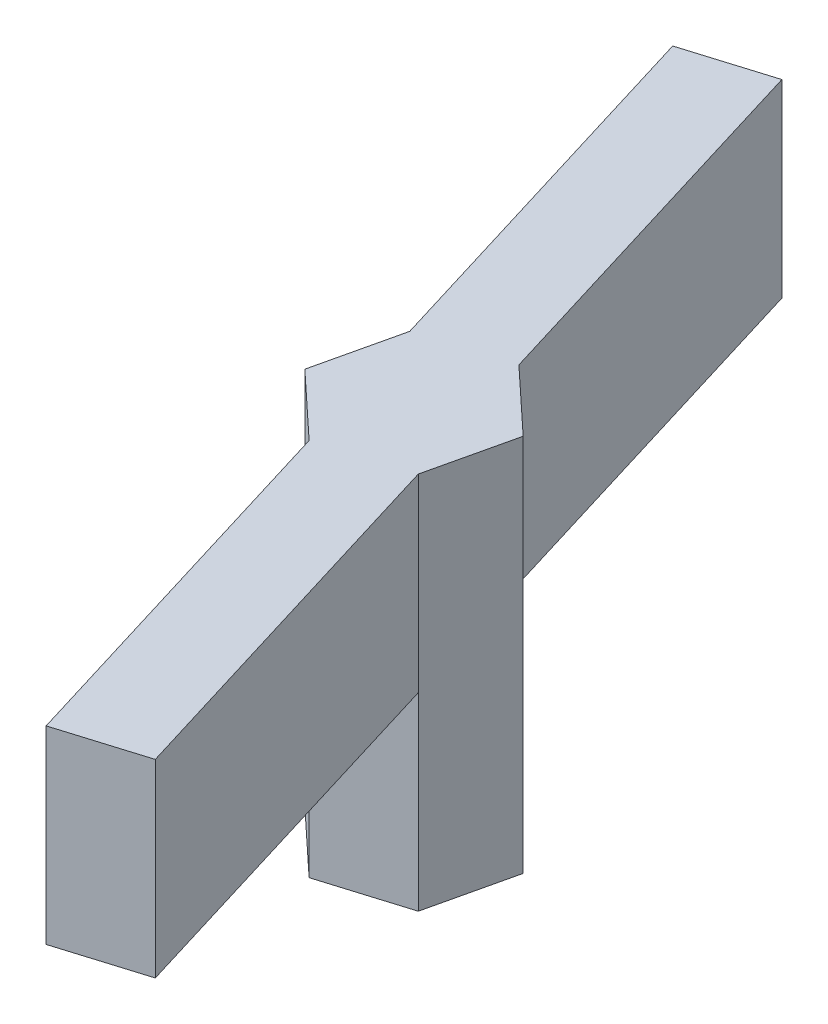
ISO-10303-21;
HEADER;
FILE_DESCRIPTION(('STEP AP214'),'2;1');
FILE_NAME('part.step','',(''),(''),'','','');
FILE_SCHEMA(('AUTOMOTIVE_DESIGN { 1 0 10303 214 1 1 1 1 }'));
ENDSEC;
DATA;
#1=APPLICATION_CONTEXT('core data for automotive mechanical design processes');
#2=APPLICATION_PROTOCOL_DEFINITION('international standard','automotive_design',2000,#1);
#3=PRODUCT_CONTEXT('',#1,'mechanical');
#4=PRODUCT('Part','Part','',(#3));
#5=PRODUCT_RELATED_PRODUCT_CATEGORY('part','',(#4));
#6=PRODUCT_DEFINITION_FORMATION('','',#4);
#7=PRODUCT_DEFINITION_CONTEXT('part definition',#1,'design');
#8=PRODUCT_DEFINITION('design','',#6,#7);
#9=PRODUCT_DEFINITION_SHAPE('','',#8);
#10=(LENGTH_UNIT() NAMED_UNIT(*) SI_UNIT(.MILLI.,.METRE.));
#11=(NAMED_UNIT(*) PLANE_ANGLE_UNIT() SI_UNIT($,.RADIAN.));
#12=(NAMED_UNIT(*) SI_UNIT($,.STERADIAN.) SOLID_ANGLE_UNIT());
#13=UNCERTAINTY_MEASURE_WITH_UNIT(LENGTH_MEASURE(1.E-05),#10,'distance_accuracy_value','');
#14=(GEOMETRIC_REPRESENTATION_CONTEXT(3) GLOBAL_UNCERTAINTY_ASSIGNED_CONTEXT((#13)) GLOBAL_UNIT_ASSIGNED_CONTEXT((#10,
#11,#12)) REPRESENTATION_CONTEXT('',''));
#15=CARTESIAN_POINT('',(0.,0.,0.));
#16=DIRECTION('',(0.,0.,1.));
#17=DIRECTION('',(1.,0.,0.));
#18=AXIS2_PLACEMENT_3D('',#15,#16,#17);
#19=CARTESIAN_POINT('',(-0.520170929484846,5.,2.25005678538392));
#20=DIRECTION('',(-0.292087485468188,0.,-0.956391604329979));
#21=DIRECTION('',(-0.956391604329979,0.,0.292087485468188));
#22=AXIS2_PLACEMENT_3D('',#19,#20,#21);
#23=PLANE('',#22);
#24=DIRECTION('',(0.956391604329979,0.,-0.292087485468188));
#25=VECTOR('',#24,1.);
#26=CARTESIAN_POINT('',(-0.520170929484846,0.,2.25005678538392));
#27=LINE('',#26,#25);
#28=CARTESIAN_POINT('',(-0.520170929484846,0.,2.25005678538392));
#29=VERTEX_POINT('',#28);
#30=CARTESIAN_POINT('',(1.6885208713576,0.,1.575509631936));
#31=VERTEX_POINT('',#30);
#32=EDGE_CURVE('E204',#29,#31,#27,.T.);
#33=ORIENTED_EDGE('',*,*,#32,.T.);
#34=DIRECTION('',(0.,-1.,0.));
#35=VECTOR('',#34,1.);
#36=CARTESIAN_POINT('',(1.6885208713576,5.,1.575509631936));
#37=LINE('',#36,#35);
#38=CARTESIAN_POINT('',(1.6885208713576,5.,1.575509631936));
#39=VERTEX_POINT('',#38);
#40=EDGE_CURVE('E11',#39,#31,#37,.T.);
#41=ORIENTED_EDGE('',*,*,#40,.F.);
#42=DIRECTION('',(0.956391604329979,0.,-0.292087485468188));
#43=VECTOR('',#42,1.);
#44=CARTESIAN_POINT('',(-0.520170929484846,5.,2.25005678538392));
#45=LINE('',#44,#43);
#46=CARTESIAN_POINT('',(-0.520170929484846,5.,2.25005678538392));
#47=VERTEX_POINT('',#46);
#48=EDGE_CURVE('E205',#47,#39,#45,.T.);
#49=ORIENTED_EDGE('',*,*,#48,.F.);
#50=DIRECTION('',(0.,-1.,0.));
#51=VECTOR('',#50,1.);
#52=CARTESIAN_POINT('',(-0.520170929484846,5.,2.25005678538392));
#53=LINE('',#52,#51);
#54=EDGE_CURVE('E49',#47,#29,#53,.T.);
#55=ORIENTED_EDGE('',*,*,#54,.T.);
#56=EDGE_LOOP('',(#33,#41,#49,#55));
#57=FACE_BOUND('',#56,.T.);
#58=ADVANCED_FACE('F33',(#57),#23,.F.);
#59=CARTESIAN_POINT('',(1.6885208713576,5.,1.575509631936));
#60=DIRECTION('',(-0.974303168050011,0.,-0.225240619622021));
#61=DIRECTION('',(-0.225240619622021,0.,0.974303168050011));
#62=AXIS2_PLACEMENT_3D('',#59,#60,#61);
#63=PLANE('',#62);
#64=DIRECTION('',(0.225240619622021,0.,-0.974303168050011));
#65=VECTOR('',#64,1.);
#66=CARTESIAN_POINT('',(1.6885208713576,0.,1.575509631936));
#67=LINE('',#66,#65);
#68=CARTESIAN_POINT('',(2.20869180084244,0.,-0.674547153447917));
#69=VERTEX_POINT('',#68);
#70=EDGE_CURVE('E211',#31,#69,#67,.T.);
#71=ORIENTED_EDGE('',*,*,#70,.T.);
#72=DIRECTION('',(0.,-1.,0.));
#73=VECTOR('',#72,1.);
#74=CARTESIAN_POINT('',(2.20869180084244,5.,-0.674547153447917));
#75=LINE('',#74,#73);
#76=CARTESIAN_POINT('',(2.20869180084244,10.,-0.674547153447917));
#77=VERTEX_POINT('',#76);
#78=EDGE_CURVE('E41',#77,#69,#75,.T.);
#79=ORIENTED_EDGE('',*,*,#78,.F.);
#80=DIRECTION('',(-0.225240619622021,0.,0.974303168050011));
#81=VECTOR('',#80,1.);
#82=CARTESIAN_POINT('',(2.20869180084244,10.,-0.674547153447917));
#83=LINE('',#82,#81);
#84=CARTESIAN_POINT('',(1.6885208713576,10.,1.575509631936));
#85=VERTEX_POINT('',#84);
#86=EDGE_CURVE('E160',#77,#85,#83,.T.);
#87=ORIENTED_EDGE('',*,*,#86,.T.);
#88=DIRECTION('',(0.,-1.,0.));
#89=VECTOR('',#88,1.);
#90=CARTESIAN_POINT('',(1.6885208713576,10.,1.575509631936));
#91=LINE('',#90,#89);
#92=EDGE_CURVE('E196',#85,#39,#91,.T.);
#93=ORIENTED_EDGE('',*,*,#92,.T.);
#94=ORIENTED_EDGE('',*,*,#40,.T.);
#95=EDGE_LOOP('',(#71,#79,#87,#93,#94));
#96=FACE_BOUND('',#95,.T.);
#97=ADVANCED_FACE('F249',(#96),#63,.F.);
#98=CARTESIAN_POINT('',(2.20869180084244,5.,-0.674547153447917));
#99=DIRECTION('',(-0.682215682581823,0.,0.731150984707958));
#100=DIRECTION('',(0.731150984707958,0.,0.682215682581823));
#101=AXIS2_PLACEMENT_3D('',#98,#99,#100);
#102=PLANE('',#101);
#103=DIRECTION('',(-0.731150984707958,0.,-0.682215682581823));
#104=VECTOR('',#103,1.);
#105=CARTESIAN_POINT('',(2.20869180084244,0.,-0.674547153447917));
#106=LINE('',#105,#104);
#107=CARTESIAN_POINT('',(0.520170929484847,0.,-2.25005678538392));
#108=VERTEX_POINT('',#107);
#109=EDGE_CURVE('E213',#69,#108,#106,.T.);
#110=ORIENTED_EDGE('',*,*,#109,.T.);
#111=DIRECTION('',(0.,-1.,0.));
#112=VECTOR('',#111,1.);
#113=CARTESIAN_POINT('',(0.520170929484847,5.,-2.25005678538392));
#114=LINE('',#113,#112);
#115=CARTESIAN_POINT('',(0.520170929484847,5.,-2.25005678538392));
#116=VERTEX_POINT('',#115);
#117=EDGE_CURVE('E221',#116,#108,#114,.T.);
#118=ORIENTED_EDGE('',*,*,#117,.F.);
#119=DIRECTION('',(0.,-1.,0.));
#120=VECTOR('',#119,1.);
#121=CARTESIAN_POINT('',(0.520170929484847,10.,-2.25005678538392));
#122=LINE('',#121,#120);
#123=CARTESIAN_POINT('',(0.520170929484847,10.,-2.25005678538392));
#124=VERTEX_POINT('',#123);
#125=EDGE_CURVE('E193',#124,#116,#122,.T.);
#126=ORIENTED_EDGE('',*,*,#125,.F.);
#127=DIRECTION('',(0.731150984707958,0.,0.682215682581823));
#128=VECTOR('',#127,1.);
#129=CARTESIAN_POINT('',(0.520170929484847,10.,-2.25005678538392));
#130=LINE('',#129,#128);
#131=EDGE_CURVE('E163',#124,#77,#130,.T.);
#132=ORIENTED_EDGE('',*,*,#131,.T.);
#133=ORIENTED_EDGE('',*,*,#78,.T.);
#134=EDGE_LOOP('',(#110,#118,#126,#132,#133));
#135=FACE_BOUND('',#134,.T.);
#136=ADVANCED_FACE('F226',(#135),#102,.F.);
#137=CARTESIAN_POINT('',(0.520170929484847,5.,-2.25005678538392));
#138=DIRECTION('',(0.292087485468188,0.,0.956391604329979));
#139=DIRECTION('',(0.956391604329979,0.,-0.292087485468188));
#140=AXIS2_PLACEMENT_3D('',#137,#138,#139);
#141=PLANE('',#140);
#142=DIRECTION('',(-0.956391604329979,0.,0.292087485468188));
#143=VECTOR('',#142,1.);
#144=CARTESIAN_POINT('',(0.520170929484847,0.,-2.25005678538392));
#145=LINE('',#144,#143);
#146=CARTESIAN_POINT('',(-1.6885208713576,0.,-1.575509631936));
#147=VERTEX_POINT('',#146);
#148=EDGE_CURVE('E215',#108,#147,#145,.T.);
#149=ORIENTED_EDGE('',*,*,#148,.T.);
#150=DIRECTION('',(0.,-1.,0.));
#151=VECTOR('',#150,1.);
#152=CARTESIAN_POINT('',(-1.6885208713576,5.,-1.575509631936));
#153=LINE('',#152,#151);
#154=CARTESIAN_POINT('',(-1.6885208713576,5.,-1.575509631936));
#155=VERTEX_POINT('',#154);
#156=EDGE_CURVE('E133',#155,#147,#153,.T.);
#157=ORIENTED_EDGE('',*,*,#156,.F.);
#158=DIRECTION('',(-0.956391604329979,0.,0.292087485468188));
#159=VECTOR('',#158,1.);
#160=CARTESIAN_POINT('',(0.520170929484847,5.,-2.25005678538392));
#161=LINE('',#160,#159);
#162=EDGE_CURVE('E207',#116,#155,#161,.T.);
#163=ORIENTED_EDGE('',*,*,#162,.F.);
#164=ORIENTED_EDGE('',*,*,#117,.T.);
#165=EDGE_LOOP('',(#149,#157,#163,#164));
#166=FACE_BOUND('',#165,.T.);
#167=ADVANCED_FACE('F235',(#166),#141,.F.);
#168=CARTESIAN_POINT('',(-1.6885208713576,5.,-1.575509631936));
#169=DIRECTION('',(0.974303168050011,0.,0.225240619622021));
#170=DIRECTION('',(0.225240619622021,0.,-0.974303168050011));
#171=AXIS2_PLACEMENT_3D('',#168,#169,#170);
#172=PLANE('',#171);
#173=DIRECTION('',(-0.225240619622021,0.,0.974303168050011));
#174=VECTOR('',#173,1.);
#175=CARTESIAN_POINT('',(-1.6885208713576,0.,-1.575509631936));
#176=LINE('',#175,#174);
#177=CARTESIAN_POINT('',(-2.20869180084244,0.,0.674547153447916));
#178=VERTEX_POINT('',#177);
#179=EDGE_CURVE('E74',#147,#178,#176,.T.);
#180=ORIENTED_EDGE('',*,*,#179,.T.);
#181=DIRECTION('',(0.,-1.,0.));
#182=VECTOR('',#181,1.);
#183=CARTESIAN_POINT('',(-2.20869180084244,5.,0.674547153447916));
#184=LINE('',#183,#182);
#185=CARTESIAN_POINT('',(-2.20869180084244,10.,0.674547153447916));
#186=VERTEX_POINT('',#185);
#187=EDGE_CURVE('E126',#186,#178,#184,.T.);
#188=ORIENTED_EDGE('',*,*,#187,.F.);
#189=DIRECTION('',(-0.225240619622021,0.,0.974303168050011));
#190=VECTOR('',#189,1.);
#191=CARTESIAN_POINT('',(-1.6885208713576,10.,-1.575509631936));
#192=LINE('',#191,#190);
#193=CARTESIAN_POINT('',(-1.6885208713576,10.,-1.575509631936));
#194=VERTEX_POINT('',#193);
#195=EDGE_CURVE('E131',#194,#186,#192,.T.);
#196=ORIENTED_EDGE('',*,*,#195,.F.);
#197=DIRECTION('',(0.,-1.,0.));
#198=VECTOR('',#197,1.);
#199=CARTESIAN_POINT('',(-1.6885208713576,10.,-1.575509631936));
#200=LINE('',#199,#198);
#201=EDGE_CURVE('E173',#194,#155,#200,.T.);
#202=ORIENTED_EDGE('',*,*,#201,.T.);
#203=ORIENTED_EDGE('',*,*,#156,.T.);
#204=EDGE_LOOP('',(#180,#188,#196,#202,#203));
#205=FACE_BOUND('',#204,.T.);
#206=ADVANCED_FACE('F128',(#205),#172,.F.);
#207=CARTESIAN_POINT('',(-2.20869180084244,5.,0.674547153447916));
#208=DIRECTION('',(0.682215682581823,0.,-0.731150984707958));
#209=DIRECTION('',(-0.731150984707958,0.,-0.682215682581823));
#210=AXIS2_PLACEMENT_3D('',#207,#208,#209);
#211=PLANE('',#210);
#212=DIRECTION('',(0.731150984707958,0.,0.682215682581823));
#213=VECTOR('',#212,1.);
#214=CARTESIAN_POINT('',(-2.20869180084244,0.,0.674547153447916));
#215=LINE('',#214,#213);
#216=EDGE_CURVE('E77',#178,#29,#215,.T.);
#217=ORIENTED_EDGE('',*,*,#216,.T.);
#218=ORIENTED_EDGE('',*,*,#54,.F.);
#219=DIRECTION('',(0.,-1.,0.));
#220=VECTOR('',#219,1.);
#221=CARTESIAN_POINT('',(-0.520170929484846,10.,2.25005678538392));
#222=LINE('',#221,#220);
#223=CARTESIAN_POINT('',(-0.520170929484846,10.,2.25005678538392));
#224=VERTEX_POINT('',#223);
#225=EDGE_CURVE('E138',#224,#47,#222,.T.);
#226=ORIENTED_EDGE('',*,*,#225,.F.);
#227=DIRECTION('',(0.731150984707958,0.,0.682215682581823));
#228=VECTOR('',#227,1.);
#229=CARTESIAN_POINT('',(-2.20869180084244,10.,0.674547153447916));
#230=LINE('',#229,#228);
#231=EDGE_CURVE('E135',#186,#224,#230,.T.);
#232=ORIENTED_EDGE('',*,*,#231,.F.);
#233=ORIENTED_EDGE('',*,*,#187,.T.);
#234=EDGE_LOOP('',(#217,#218,#226,#232,#233));
#235=FACE_BOUND('',#234,.T.);
#236=ADVANCED_FACE('F136',(#235),#211,.F.);
#237=CARTESIAN_POINT('',(0.,0.,0.));
#238=DIRECTION('',(0.,1.,0.));
#239=DIRECTION('',(0.,0.,1.));
#240=AXIS2_PLACEMENT_3D('',#237,#238,#239);
#241=PLANE('',#240);
#242=ORIENTED_EDGE('',*,*,#32,.F.);
#243=ORIENTED_EDGE('',*,*,#216,.F.);
#244=ORIENTED_EDGE('',*,*,#179,.F.);
#245=ORIENTED_EDGE('',*,*,#148,.F.);
#246=ORIENTED_EDGE('',*,*,#109,.F.);
#247=ORIENTED_EDGE('',*,*,#70,.F.);
#248=EDGE_LOOP('',(#242,#243,#244,#245,#246,#247));
#249=FACE_BOUND('',#248,.T.);
#250=ADVANCED_FACE('F233',(#249),#241,.F.);
#251=CARTESIAN_POINT('',(0.,5.,0.));
#252=DIRECTION('',(0.,1.,0.));
#253=DIRECTION('',(0.,0.,1.));
#254=AXIS2_PLACEMENT_3D('',#251,#252,#253);
#255=PLANE('',#254);
#256=DIRECTION('',(0.292087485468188,0.,0.956391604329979));
#257=VECTOR('',#256,1.);
#258=CARTESIAN_POINT('',(-0.520170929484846,5.,2.25005678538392));
#259=LINE('',#258,#257);
#260=CARTESIAN_POINT('',(2.5338864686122,5.,12.2500567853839));
#261=VERTEX_POINT('',#260);
#262=EDGE_CURVE('E174',#47,#261,#259,.T.);
#263=ORIENTED_EDGE('',*,*,#262,.F.);
#264=ORIENTED_EDGE('',*,*,#48,.T.);
#265=DIRECTION('',(0.292087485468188,0.,0.956391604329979));
#266=VECTOR('',#265,1.);
#267=CARTESIAN_POINT('',(1.6885208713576,5.,1.575509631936));
#268=LINE('',#267,#266);
#269=CARTESIAN_POINT('',(4.74257826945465,5.,11.575509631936));
#270=VERTEX_POINT('',#269);
#271=EDGE_CURVE('E180',#39,#270,#268,.T.);
#272=ORIENTED_EDGE('',*,*,#271,.T.);
#273=DIRECTION('',(-0.956391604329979,0.,0.29208748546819));
#274=VECTOR('',#273,1.);
#275=CARTESIAN_POINT('',(4.74257826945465,5.,11.575509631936));
#276=LINE('',#275,#274);
#277=EDGE_CURVE('E177',#270,#261,#276,.T.);
#278=ORIENTED_EDGE('',*,*,#277,.T.);
#279=EDGE_LOOP('',(#263,#264,#272,#278));
#280=FACE_BOUND('',#279,.T.);
#281=ADVANCED_FACE('F256',(#280),#255,.F.);
#282=DIRECTION('',(0.292087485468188,0.,0.956391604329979));
#283=VECTOR('',#282,1.);
#284=CARTESIAN_POINT('',(-2.53388646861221,5.,-12.2500567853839));
#285=LINE('',#284,#283);
#286=CARTESIAN_POINT('',(-2.53388646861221,5.,-12.2500567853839));
#287=VERTEX_POINT('',#286);
#288=EDGE_CURVE('E183',#287,#116,#285,.T.);
#289=ORIENTED_EDGE('',*,*,#288,.T.);
#290=ORIENTED_EDGE('',*,*,#162,.T.);
#291=DIRECTION('',(-0.292087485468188,0.,-0.956391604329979));
#292=VECTOR('',#291,1.);
#293=CARTESIAN_POINT('',(-1.6885208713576,5.,-1.575509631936));
#294=LINE('',#293,#292);
#295=CARTESIAN_POINT('',(-4.74257826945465,5.,-11.575509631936));
#296=VERTEX_POINT('',#295);
#297=EDGE_CURVE('E147',#155,#296,#294,.T.);
#298=ORIENTED_EDGE('',*,*,#297,.T.);
#299=DIRECTION('',(0.956391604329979,0.,-0.292087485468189));
#300=VECTOR('',#299,1.);
#301=CARTESIAN_POINT('',(-4.74257826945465,5.,-11.575509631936));
#302=LINE('',#301,#300);
#303=EDGE_CURVE('E150',#296,#287,#302,.T.);
#304=ORIENTED_EDGE('',*,*,#303,.T.);
#305=EDGE_LOOP('',(#289,#290,#298,#304));
#306=FACE_BOUND('',#305,.T.);
#307=ADVANCED_FACE('F242',(#306),#255,.F.);
#308=CARTESIAN_POINT('',(-0.520170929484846,10.,2.25005678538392));
#309=DIRECTION('',(0.956391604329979,0.,-0.292087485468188));
#310=DIRECTION('',(-0.292087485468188,0.,-0.956391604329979));
#311=AXIS2_PLACEMENT_3D('',#308,#309,#310);
#312=PLANE('',#311);
#313=ORIENTED_EDGE('',*,*,#262,.T.);
#314=DIRECTION('',(0.,-1.,0.));
#315=VECTOR('',#314,1.);
#316=CARTESIAN_POINT('',(2.5338864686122,10.,12.2500567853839));
#317=LINE('',#316,#315);
#318=CARTESIAN_POINT('',(2.5338864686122,10.,12.2500567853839));
#319=VERTEX_POINT('',#318);
#320=EDGE_CURVE('E201',#319,#261,#317,.T.);
#321=ORIENTED_EDGE('',*,*,#320,.F.);
#322=DIRECTION('',(0.292087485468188,0.,0.956391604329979));
#323=VECTOR('',#322,1.);
#324=CARTESIAN_POINT('',(-0.520170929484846,10.,2.25005678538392));
#325=LINE('',#324,#323);
#326=EDGE_CURVE('E141',#224,#319,#325,.T.);
#327=ORIENTED_EDGE('',*,*,#326,.F.);
#328=ORIENTED_EDGE('',*,*,#225,.T.);
#329=EDGE_LOOP('',(#313,#321,#327,#328));
#330=FACE_BOUND('',#329,.T.);
#331=ADVANCED_FACE('F258',(#330),#312,.F.);
#332=CARTESIAN_POINT('',(4.74257826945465,10.,11.575509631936));
#333=DIRECTION('',(0.29208748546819,0.,0.956391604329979));
#334=DIRECTION('',(0.956391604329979,0.,-0.29208748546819));
#335=AXIS2_PLACEMENT_3D('',#332,#333,#334);
#336=PLANE('',#335);
#337=ORIENTED_EDGE('',*,*,#277,.F.);
#338=DIRECTION('',(0.,-1.,0.));
#339=VECTOR('',#338,1.);
#340=CARTESIAN_POINT('',(4.74257826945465,10.,11.575509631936));
#341=LINE('',#340,#339);
#342=CARTESIAN_POINT('',(4.74257826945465,10.,11.575509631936));
#343=VERTEX_POINT('',#342);
#344=EDGE_CURVE('E199',#343,#270,#341,.T.);
#345=ORIENTED_EDGE('',*,*,#344,.F.);
#346=DIRECTION('',(-0.956391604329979,0.,0.29208748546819));
#347=VECTOR('',#346,1.);
#348=CARTESIAN_POINT('',(4.74257826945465,10.,11.575509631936));
#349=LINE('',#348,#347);
#350=EDGE_CURVE('E154',#343,#319,#349,.T.);
#351=ORIENTED_EDGE('',*,*,#350,.T.);
#352=ORIENTED_EDGE('',*,*,#320,.T.);
#353=EDGE_LOOP('',(#337,#345,#351,#352));
#354=FACE_BOUND('',#353,.T.);
#355=ADVANCED_FACE('F261',(#354),#336,.T.);
#356=CARTESIAN_POINT('',(1.6885208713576,10.,1.575509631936));
#357=DIRECTION('',(0.956391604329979,0.,-0.292087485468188));
#358=DIRECTION('',(-0.292087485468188,0.,-0.956391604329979));
#359=AXIS2_PLACEMENT_3D('',#356,#357,#358);
#360=PLANE('',#359);
#361=ORIENTED_EDGE('',*,*,#271,.F.);
#362=ORIENTED_EDGE('',*,*,#92,.F.);
#363=DIRECTION('',(0.292087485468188,0.,0.956391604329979));
#364=VECTOR('',#363,1.);
#365=CARTESIAN_POINT('',(1.6885208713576,10.,1.575509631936));
#366=LINE('',#365,#364);
#367=EDGE_CURVE('E157',#85,#343,#366,.T.);
#368=ORIENTED_EDGE('',*,*,#367,.T.);
#369=ORIENTED_EDGE('',*,*,#344,.T.);
#370=EDGE_LOOP('',(#361,#362,#368,#369));
#371=FACE_BOUND('',#370,.T.);
#372=ADVANCED_FACE('F252',(#371),#360,.T.);
#373=CARTESIAN_POINT('',(-2.53388646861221,10.,-12.2500567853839));
#374=DIRECTION('',(0.956391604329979,0.,-0.292087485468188));
#375=DIRECTION('',(-0.292087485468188,0.,-0.956391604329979));
#376=AXIS2_PLACEMENT_3D('',#373,#374,#375);
#377=PLANE('',#376);
#378=ORIENTED_EDGE('',*,*,#288,.F.);
#379=DIRECTION('',(0.,-1.,0.));
#380=VECTOR('',#379,1.);
#381=CARTESIAN_POINT('',(-2.53388646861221,10.,-12.2500567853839));
#382=LINE('',#381,#380);
#383=CARTESIAN_POINT('',(-2.53388646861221,10.,-12.2500567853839));
#384=VERTEX_POINT('',#383);
#385=EDGE_CURVE('E191',#384,#287,#382,.T.);
#386=ORIENTED_EDGE('',*,*,#385,.F.);
#387=DIRECTION('',(0.292087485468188,0.,0.956391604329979));
#388=VECTOR('',#387,1.);
#389=CARTESIAN_POINT('',(-2.53388646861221,10.,-12.2500567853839));
#390=LINE('',#389,#388);
#391=EDGE_CURVE('E166',#384,#124,#390,.T.);
#392=ORIENTED_EDGE('',*,*,#391,.T.);
#393=ORIENTED_EDGE('',*,*,#125,.T.);
#394=EDGE_LOOP('',(#378,#386,#392,#393));
#395=FACE_BOUND('',#394,.T.);
#396=ADVANCED_FACE('F245',(#395),#377,.T.);
#397=CARTESIAN_POINT('',(-4.74257826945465,10.,-11.575509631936));
#398=DIRECTION('',(-0.292087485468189,0.,-0.956391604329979));
#399=DIRECTION('',(-0.956391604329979,0.,0.292087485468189));
#400=AXIS2_PLACEMENT_3D('',#397,#398,#399);
#401=PLANE('',#400);
#402=ORIENTED_EDGE('',*,*,#303,.F.);
#403=DIRECTION('',(0.,-1.,0.));
#404=VECTOR('',#403,1.);
#405=CARTESIAN_POINT('',(-4.74257826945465,10.,-11.575509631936));
#406=LINE('',#405,#404);
#407=CARTESIAN_POINT('',(-4.74257826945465,10.,-11.575509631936));
#408=VERTEX_POINT('',#407);
#409=EDGE_CURVE('E189',#408,#296,#406,.T.);
#410=ORIENTED_EDGE('',*,*,#409,.F.);
#411=DIRECTION('',(0.956391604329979,0.,-0.292087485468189));
#412=VECTOR('',#411,1.);
#413=CARTESIAN_POINT('',(-4.74257826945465,10.,-11.575509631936));
#414=LINE('',#413,#412);
#415=EDGE_CURVE('E169',#408,#384,#414,.T.);
#416=ORIENTED_EDGE('',*,*,#415,.T.);
#417=ORIENTED_EDGE('',*,*,#385,.T.);
#418=EDGE_LOOP('',(#402,#410,#416,#417));
#419=FACE_BOUND('',#418,.T.);
#420=ADVANCED_FACE('F297',(#419),#401,.T.);
#421=CARTESIAN_POINT('',(-1.6885208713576,10.,-1.575509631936));
#422=DIRECTION('',(-0.956391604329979,0.,0.292087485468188));
#423=DIRECTION('',(0.292087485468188,0.,0.956391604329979));
#424=AXIS2_PLACEMENT_3D('',#421,#422,#423);
#425=PLANE('',#424);
#426=ORIENTED_EDGE('',*,*,#297,.F.);
#427=ORIENTED_EDGE('',*,*,#201,.F.);
#428=DIRECTION('',(-0.292087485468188,0.,-0.956391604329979));
#429=VECTOR('',#428,1.);
#430=CARTESIAN_POINT('',(-1.6885208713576,10.,-1.575509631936));
#431=LINE('',#430,#429);
#432=EDGE_CURVE('E146',#194,#408,#431,.T.);
#433=ORIENTED_EDGE('',*,*,#432,.T.);
#434=ORIENTED_EDGE('',*,*,#409,.T.);
#435=EDGE_LOOP('',(#426,#427,#433,#434));
#436=FACE_BOUND('',#435,.T.);
#437=ADVANCED_FACE('F239',(#436),#425,.T.);
#438=CARTESIAN_POINT('',(0.,10.,0.));
#439=DIRECTION('',(0.,1.,0.));
#440=DIRECTION('',(0.,0.,1.));
#441=AXIS2_PLACEMENT_3D('',#438,#439,#440);
#442=PLANE('',#441);
#443=ORIENTED_EDGE('',*,*,#195,.T.);
#444=ORIENTED_EDGE('',*,*,#231,.T.);
#445=ORIENTED_EDGE('',*,*,#326,.T.);
#446=ORIENTED_EDGE('',*,*,#350,.F.);
#447=ORIENTED_EDGE('',*,*,#367,.F.);
#448=ORIENTED_EDGE('',*,*,#86,.F.);
#449=ORIENTED_EDGE('',*,*,#131,.F.);
#450=ORIENTED_EDGE('',*,*,#391,.F.);
#451=ORIENTED_EDGE('',*,*,#415,.F.);
#452=ORIENTED_EDGE('',*,*,#432,.F.);
#453=EDGE_LOOP('',(#443,#444,#445,#446,#447,#448,#449,#450,#451,#452));
#454=FACE_BOUND('',#453,.T.);
#455=ADVANCED_FACE('F143',(#454),#442,.T.);
#456=CLOSED_SHELL('',(#58,#97,#136,#167,#206,#236,#250,#281,#307,#331,#355,#372,#396,#420,#437,#455));
#457=MANIFOLD_SOLID_BREP('B2',#456);
#458=ADVANCED_BREP_SHAPE_REPRESENTATION('',(#18,#457),#14);
#459=SHAPE_DEFINITION_REPRESENTATION(#9,#458);
ENDSEC;
END-ISO-10303-21;
